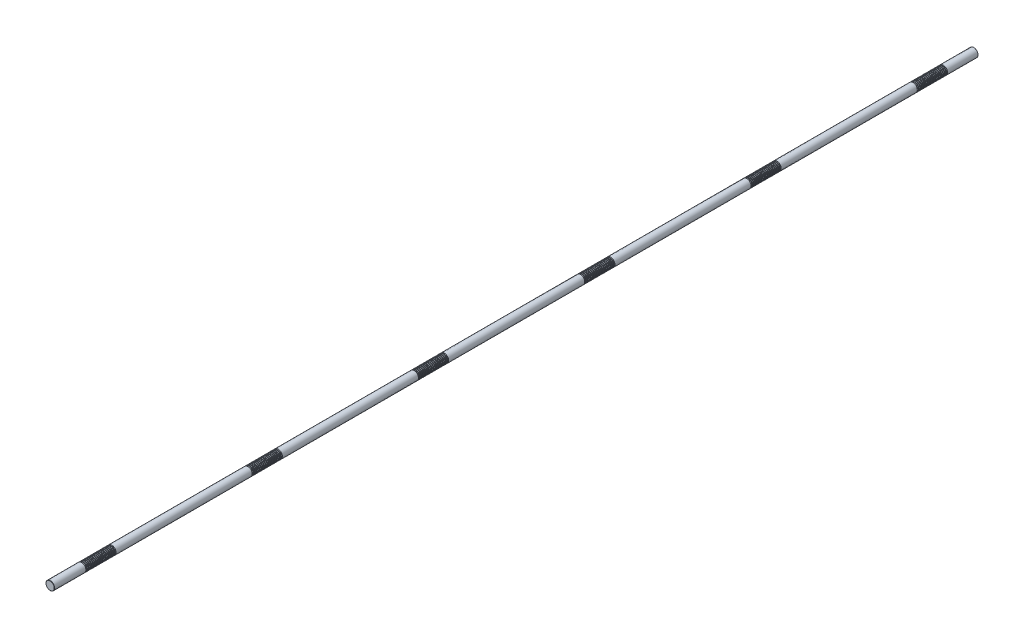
from build123d import *

# Parameters (mm, degrees)
SKETCH1_R           = 14
BOSS_EXTRUDE1_DEPTH = 1500
CHAMFER1_SIZE       = 0.7
LPATTERN1_COUNT     = 20
LPATTERN1_PITCH     = 5
LPATTERN2_COUNT     = 6
LPATTERN2_PITCH     = 540


with BuildPart() as part:
    # Sketch1 → Boss-Extrude1 (new, symmetric)
    with BuildSketch(Plane.XY):
        Circle(SKETCH1_R)
    extrude(amount=BOSS_EXTRUDE1_DEPTH, both=True)

    # Chamfer1
    chamfer1_edges = [part.edges().sort_by_distance(p)[0] for p in [
        (-14, 0, -1500),
        (-14, 0, 1500),
    ]]
    chamfer(chamfer1_edges, length=CHAMFER1_SIZE)

    # Sketch2 → Cut-Revolve1 (revolve, cut)
    with BuildSketch(Plane(origin=(0, 0, 0), x_dir=(0, 0, -1), z_dir=(1, 0, 0)), mode=Mode.PRIVATE) as cut_revolve1_sk:
        Polygon((1400.36843014, 14), (1397.13156986, 14), (1397.86843014, 11.25), (1399.63156986, 11.25), align=None)
    cut_revolve1 = revolve(cut_revolve1_sk.sketch.rotate(Axis((0, 0, 1500), (0, 0, -1)), 90), axis=Axis((0, 0, 1500), (0, 0, -1)), mode=Mode.SUBTRACT)

    # LPattern1: Cut-Revolve1 ×20
    with Locations(*[(0, 0, i * LPATTERN1_PITCH) for i in range(1, LPATTERN1_COUNT)]):
        add(cut_revolve1, mode=Mode.SUBTRACT)

    # LPattern2: Cut-Revolve1 ×6
    with Locations(*[(0, 0, i * LPATTERN2_PITCH) for i in range(1, LPATTERN2_COUNT)]):
        add(cut_revolve1, mode=Mode.SUBTRACT)

    # LPattern2 copy 1 sketch → LPattern2 copy 1 (revolve, cut)
    with BuildSketch(Plane(origin=(0, 0, 545), x_dir=(0, 0, -1), z_dir=(1, 0, 0))):
        Polygon((1400.36843014, 14), (1397.13156986, 14), (1397.86843014, 11.25), (1399.63156986, 11.25), align=None)
    revolve(axis=Axis((0, 0, 2045), (0, 0, -1)), mode=Mode.SUBTRACT)

    # LPattern2 copy 2 sketch → LPattern2 copy 2 (revolve, cut)
    with BuildSketch(Plane(origin=(0, 0, 1085), x_dir=(0, 0, -1), z_dir=(1, 0, 0))):
        Polygon((1400.36843014, 14), (1397.13156986, 14), (1397.86843014, 11.25), (1399.63156986, 11.25), align=None)
    revolve(axis=Axis((0, 0, 2585), (0, 0, -1)), mode=Mode.SUBTRACT)

    # LPattern2 copy 3 sketch → LPattern2 copy 3 (revolve, cut)
    with BuildSketch(Plane(origin=(0, 0, 1625), x_dir=(0, 0, -1), z_dir=(1, 0, 0))):
        Polygon((1400.36843014, 14), (1397.13156986, 14), (1397.86843014, 11.25), (1399.63156986, 11.25), align=None)
    revolve(axis=Axis((0, 0, 3125), (0, 0, -1)), mode=Mode.SUBTRACT)

    # LPattern2 copy 4 sketch → LPattern2 copy 4 (revolve, cut)
    with BuildSketch(Plane(origin=(0, 0, 2165), x_dir=(0, 0, -1), z_dir=(1, 0, 0))):
        Polygon((1400.36843014, 14), (1397.13156986, 14), (1397.86843014, 11.25), (1399.63156986, 11.25), align=None)
    revolve(axis=Axis((0, 0, 3665), (0, 0, -1)), mode=Mode.SUBTRACT)

    # LPattern2 copy 5 sketch → LPattern2 copy 5 (revolve, cut)
    with BuildSketch(Plane(origin=(0, 0, 2705), x_dir=(0, 0, -1), z_dir=(1, 0, 0))):
        Polygon((1400.36843014, 14), (1397.13156986, 14), (1397.86843014, 11.25), (1399.63156986, 11.25), align=None)
    revolve(axis=Axis((0, 0, 4205), (0, 0, -1)), mode=Mode.SUBTRACT)

    # LPattern2 copy 6 sketch → LPattern2 copy 6 (revolve, cut)
    with BuildSketch(Plane(origin=(0, 0, 550), x_dir=(0, 0, -1), z_dir=(1, 0, 0))):
        Polygon((1400.36843014, 14), (1397.13156986, 14), (1397.86843014, 11.25), (1399.63156986, 11.25), align=None)
    revolve(axis=Axis((0, 0, 2050), (0, 0, -1)), mode=Mode.SUBTRACT)

    # LPattern2 copy 7 sketch → LPattern2 copy 7 (revolve, cut)
    with BuildSketch(Plane(origin=(0, 0, 1090), x_dir=(0, 0, -1), z_dir=(1, 0, 0))):
        Polygon((1400.36843014, 14), (1397.13156986, 14), (1397.86843014, 11.25), (1399.63156986, 11.25), align=None)
    revolve(axis=Axis((0, 0, 2590), (0, 0, -1)), mode=Mode.SUBTRACT)

    # LPattern2 copy 8 sketch → LPattern2 copy 8 (revolve, cut)
    with BuildSketch(Plane(origin=(0, 0, 1630), x_dir=(0, 0, -1), z_dir=(1, 0, 0))):
        Polygon((1400.36843014, 14), (1397.13156986, 14), (1397.86843014, 11.25), (1399.63156986, 11.25), align=None)
    revolve(axis=Axis((0, 0, 3130), (0, 0, -1)), mode=Mode.SUBTRACT)

    # LPattern2 copy 9 sketch → LPattern2 copy 9 (revolve, cut)
    with BuildSketch(Plane(origin=(0, 0, 2170), x_dir=(0, 0, -1), z_dir=(1, 0, 0))):
        Polygon((1400.36843014, 14), (1397.13156986, 14), (1397.86843014, 11.25), (1399.63156986, 11.25), align=None)
    revolve(axis=Axis((0, 0, 3670), (0, 0, -1)), mode=Mode.SUBTRACT)

    # LPattern2 copy 10 sketch → LPattern2 copy 10 (revolve, cut)
    with BuildSketch(Plane(origin=(0, 0, 2710), x_dir=(0, 0, -1), z_dir=(1, 0, 0))):
        Polygon((1400.36843014, 14), (1397.13156986, 14), (1397.86843014, 11.25), (1399.63156986, 11.25), align=None)
    revolve(axis=Axis((0, 0, 4210), (0, 0, -1)), mode=Mode.SUBTRACT)

    # LPattern2 copy 11 sketch → LPattern2 copy 11 (revolve, cut)
    with BuildSketch(Plane(origin=(0, 0, 555), x_dir=(0, 0, -1), z_dir=(1, 0, 0))):
        Polygon((1400.36843014, 14), (1397.13156986, 14), (1397.86843014, 11.25), (1399.63156986, 11.25), align=None)
    revolve(axis=Axis((0, 0, 2055), (0, 0, -1)), mode=Mode.SUBTRACT)

    # LPattern2 copy 12 sketch → LPattern2 copy 12 (revolve, cut)
    with BuildSketch(Plane(origin=(0, 0, 1095), x_dir=(0, 0, -1), z_dir=(1, 0, 0))):
        Polygon((1400.36843014, 14), (1397.13156986, 14), (1397.86843014, 11.25), (1399.63156986, 11.25), align=None)
    revolve(axis=Axis((0, 0, 2595), (0, 0, -1)), mode=Mode.SUBTRACT)

    # LPattern2 copy 13 sketch → LPattern2 copy 13 (revolve, cut)
    with BuildSketch(Plane(origin=(0, 0, 1635), x_dir=(0, 0, -1), z_dir=(1, 0, 0))):
        Polygon((1400.36843014, 14), (1397.13156986, 14), (1397.86843014, 11.25), (1399.63156986, 11.25), align=None)
    revolve(axis=Axis((0, 0, 3135), (0, 0, -1)), mode=Mode.SUBTRACT)

    # LPattern2 copy 14 sketch → LPattern2 copy 14 (revolve, cut)
    with BuildSketch(Plane(origin=(0, 0, 2175), x_dir=(0, 0, -1), z_dir=(1, 0, 0))):
        Polygon((1400.36843014, 14), (1397.13156986, 14), (1397.86843014, 11.25), (1399.63156986, 11.25), align=None)
    revolve(axis=Axis((0, 0, 3675), (0, 0, -1)), mode=Mode.SUBTRACT)

    # LPattern2 copy 15 sketch → LPattern2 copy 15 (revolve, cut)
    with BuildSketch(Plane(origin=(0, 0, 2715), x_dir=(0, 0, -1), z_dir=(1, 0, 0))):
        Polygon((1400.36843014, 14), (1397.13156986, 14), (1397.86843014, 11.25), (1399.63156986, 11.25), align=None)
    revolve(axis=Axis((0, 0, 4215), (0, 0, -1)), mode=Mode.SUBTRACT)

    # LPattern2 copy 16 sketch → LPattern2 copy 16 (revolve, cut)
    with BuildSketch(Plane(origin=(0, 0, 560), x_dir=(0, 0, -1), z_dir=(1, 0, 0))):
        Polygon((1400.36843014, 14), (1397.13156986, 14), (1397.86843014, 11.25), (1399.63156986, 11.25), align=None)
    revolve(axis=Axis((0, 0, 2060), (0, 0, -1)), mode=Mode.SUBTRACT)

    # LPattern2 copy 17 sketch → LPattern2 copy 17 (revolve, cut)
    with BuildSketch(Plane(origin=(0, 0, 1100), x_dir=(0, 0, -1), z_dir=(1, 0, 0))):
        Polygon((1400.36843014, 14), (1397.13156986, 14), (1397.86843014, 11.25), (1399.63156986, 11.25), align=None)
    revolve(axis=Axis((0, 0, 2600), (0, 0, -1)), mode=Mode.SUBTRACT)

    # LPattern2 copy 18 sketch → LPattern2 copy 18 (revolve, cut)
    with BuildSketch(Plane(origin=(0, 0, 1640), x_dir=(0, 0, -1), z_dir=(1, 0, 0))):
        Polygon((1400.36843014, 14), (1397.13156986, 14), (1397.86843014, 11.25), (1399.63156986, 11.25), align=None)
    revolve(axis=Axis((0, 0, 3140), (0, 0, -1)), mode=Mode.SUBTRACT)

    # LPattern2 copy 19 sketch → LPattern2 copy 19 (revolve, cut)
    with BuildSketch(Plane(origin=(0, 0, 2180), x_dir=(0, 0, -1), z_dir=(1, 0, 0))):
        Polygon((1400.36843014, 14), (1397.13156986, 14), (1397.86843014, 11.25), (1399.63156986, 11.25), align=None)
    revolve(axis=Axis((0, 0, 3680), (0, 0, -1)), mode=Mode.SUBTRACT)

    # LPattern2 copy 20 sketch → LPattern2 copy 20 (revolve, cut)
    with BuildSketch(Plane(origin=(0, 0, 2720), x_dir=(0, 0, -1), z_dir=(1, 0, 0))):
        Polygon((1400.36843014, 14), (1397.13156986, 14), (1397.86843014, 11.25), (1399.63156986, 11.25), align=None)
    revolve(axis=Axis((0, 0, 4220), (0, 0, -1)), mode=Mode.SUBTRACT)

    # LPattern2 copy 21 sketch → LPattern2 copy 21 (revolve, cut)
    with BuildSketch(Plane(origin=(0, 0, 565), x_dir=(0, 0, -1), z_dir=(1, 0, 0))):
        Polygon((1400.36843014, 14), (1397.13156986, 14), (1397.86843014, 11.25), (1399.63156986, 11.25), align=None)
    revolve(axis=Axis((0, 0, 2065), (0, 0, -1)), mode=Mode.SUBTRACT)

    # LPattern2 copy 22 sketch → LPattern2 copy 22 (revolve, cut)
    with BuildSketch(Plane(origin=(0, 0, 1105), x_dir=(0, 0, -1), z_dir=(1, 0, 0))):
        Polygon((1400.36843014, 14), (1397.13156986, 14), (1397.86843014, 11.25), (1399.63156986, 11.25), align=None)
    revolve(axis=Axis((0, 0, 2605), (0, 0, -1)), mode=Mode.SUBTRACT)

    # LPattern2 copy 23 sketch → LPattern2 copy 23 (revolve, cut)
    with BuildSketch(Plane(origin=(0, 0, 1645), x_dir=(0, 0, -1), z_dir=(1, 0, 0))):
        Polygon((1400.36843014, 14), (1397.13156986, 14), (1397.86843014, 11.25), (1399.63156986, 11.25), align=None)
    revolve(axis=Axis((0, 0, 3145), (0, 0, -1)), mode=Mode.SUBTRACT)

    # LPattern2 copy 24 sketch → LPattern2 copy 24 (revolve, cut)
    with BuildSketch(Plane(origin=(0, 0, 2185), x_dir=(0, 0, -1), z_dir=(1, 0, 0))):
        Polygon((1400.36843014, 14), (1397.13156986, 14), (1397.86843014, 11.25), (1399.63156986, 11.25), align=None)
    revolve(axis=Axis((0, 0, 3685), (0, 0, -1)), mode=Mode.SUBTRACT)

    # LPattern2 copy 25 sketch → LPattern2 copy 25 (revolve, cut)
    with BuildSketch(Plane(origin=(0, 0, 2725), x_dir=(0, 0, -1), z_dir=(1, 0, 0))):
        Polygon((1400.36843014, 14), (1397.13156986, 14), (1397.86843014, 11.25), (1399.63156986, 11.25), align=None)
    revolve(axis=Axis((0, 0, 4225), (0, 0, -1)), mode=Mode.SUBTRACT)

    # LPattern2 copy 26 sketch → LPattern2 copy 26 (revolve, cut)
    with BuildSketch(Plane(origin=(0, 0, 570), x_dir=(0, 0, -1), z_dir=(1, 0, 0))):
        Polygon((1400.36843014, 14), (1397.13156986, 14), (1397.86843014, 11.25), (1399.63156986, 11.25), align=None)
    revolve(axis=Axis((0, 0, 2070), (0, 0, -1)), mode=Mode.SUBTRACT)

    # LPattern2 copy 27 sketch → LPattern2 copy 27 (revolve, cut)
    with BuildSketch(Plane(origin=(0, 0, 1110), x_dir=(0, 0, -1), z_dir=(1, 0, 0))):
        Polygon((1400.36843014, 14), (1397.13156986, 14), (1397.86843014, 11.25), (1399.63156986, 11.25), align=None)
    revolve(axis=Axis((0, 0, 2610), (0, 0, -1)), mode=Mode.SUBTRACT)

    # LPattern2 copy 28 sketch → LPattern2 copy 28 (revolve, cut)
    with BuildSketch(Plane(origin=(0, 0, 1650), x_dir=(0, 0, -1), z_dir=(1, 0, 0))):
        Polygon((1400.36843014, 14), (1397.13156986, 14), (1397.86843014, 11.25), (1399.63156986, 11.25), align=None)
    revolve(axis=Axis((0, 0, 3150), (0, 0, -1)), mode=Mode.SUBTRACT)

    # LPattern2 copy 29 sketch → LPattern2 copy 29 (revolve, cut)
    with BuildSketch(Plane(origin=(0, 0, 2190), x_dir=(0, 0, -1), z_dir=(1, 0, 0))):
        Polygon((1400.36843014, 14), (1397.13156986, 14), (1397.86843014, 11.25), (1399.63156986, 11.25), align=None)
    revolve(axis=Axis((0, 0, 3690), (0, 0, -1)), mode=Mode.SUBTRACT)

    # LPattern2 copy 30 sketch → LPattern2 copy 30 (revolve, cut)
    with BuildSketch(Plane(origin=(0, 0, 2730), x_dir=(0, 0, -1), z_dir=(1, 0, 0))):
        Polygon((1400.36843014, 14), (1397.13156986, 14), (1397.86843014, 11.25), (1399.63156986, 11.25), align=None)
    revolve(axis=Axis((0, 0, 4230), (0, 0, -1)), mode=Mode.SUBTRACT)

    # LPattern2 copy 31 sketch → LPattern2 copy 31 (revolve, cut)
    with BuildSketch(Plane(origin=(0, 0, 575), x_dir=(0, 0, -1), z_dir=(1, 0, 0))):
        Polygon((1400.36843014, 14), (1397.13156986, 14), (1397.86843014, 11.25), (1399.63156986, 11.25), align=None)
    revolve(axis=Axis((0, 0, 2075), (0, 0, -1)), mode=Mode.SUBTRACT)

    # LPattern2 copy 32 sketch → LPattern2 copy 32 (revolve, cut)
    with BuildSketch(Plane(origin=(0, 0, 1115), x_dir=(0, 0, -1), z_dir=(1, 0, 0))):
        Polygon((1400.36843014, 14), (1397.13156986, 14), (1397.86843014, 11.25), (1399.63156986, 11.25), align=None)
    revolve(axis=Axis((0, 0, 2615), (0, 0, -1)), mode=Mode.SUBTRACT)

    # LPattern2 copy 33 sketch → LPattern2 copy 33 (revolve, cut)
    with BuildSketch(Plane(origin=(0, 0, 1655), x_dir=(0, 0, -1), z_dir=(1, 0, 0))):
        Polygon((1400.36843014, 14), (1397.13156986, 14), (1397.86843014, 11.25), (1399.63156986, 11.25), align=None)
    revolve(axis=Axis((0, 0, 3155), (0, 0, -1)), mode=Mode.SUBTRACT)

    # LPattern2 copy 34 sketch → LPattern2 copy 34 (revolve, cut)
    with BuildSketch(Plane(origin=(0, 0, 2195), x_dir=(0, 0, -1), z_dir=(1, 0, 0))):
        Polygon((1400.36843014, 14), (1397.13156986, 14), (1397.86843014, 11.25), (1399.63156986, 11.25), align=None)
    revolve(axis=Axis((0, 0, 3695), (0, 0, -1)), mode=Mode.SUBTRACT)

    # LPattern2 copy 35 sketch → LPattern2 copy 35 (revolve, cut)
    with BuildSketch(Plane(origin=(0, 0, 2735), x_dir=(0, 0, -1), z_dir=(1, 0, 0))):
        Polygon((1400.36843014, 14), (1397.13156986, 14), (1397.86843014, 11.25), (1399.63156986, 11.25), align=None)
    revolve(axis=Axis((0, 0, 4235), (0, 0, -1)), mode=Mode.SUBTRACT)

    # LPattern2 copy 36 sketch → LPattern2 copy 36 (revolve, cut)
    with BuildSketch(Plane(origin=(0, 0, 580), x_dir=(0, 0, -1), z_dir=(1, 0, 0))):
        Polygon((1400.36843014, 14), (1397.13156986, 14), (1397.86843014, 11.25), (1399.63156986, 11.25), align=None)
    revolve(axis=Axis((0, 0, 2080), (0, 0, -1)), mode=Mode.SUBTRACT)

    # LPattern2 copy 37 sketch → LPattern2 copy 37 (revolve, cut)
    with BuildSketch(Plane(origin=(0, 0, 1120), x_dir=(0, 0, -1), z_dir=(1, 0, 0))):
        Polygon((1400.36843014, 14), (1397.13156986, 14), (1397.86843014, 11.25), (1399.63156986, 11.25), align=None)
    revolve(axis=Axis((0, 0, 2620), (0, 0, -1)), mode=Mode.SUBTRACT)

    # LPattern2 copy 38 sketch → LPattern2 copy 38 (revolve, cut)
    with BuildSketch(Plane(origin=(0, 0, 1660), x_dir=(0, 0, -1), z_dir=(1, 0, 0))):
        Polygon((1400.36843014, 14), (1397.13156986, 14), (1397.86843014, 11.25), (1399.63156986, 11.25), align=None)
    revolve(axis=Axis((0, 0, 3160), (0, 0, -1)), mode=Mode.SUBTRACT)

    # LPattern2 copy 39 sketch → LPattern2 copy 39 (revolve, cut)
    with BuildSketch(Plane(origin=(0, 0, 2200), x_dir=(0, 0, -1), z_dir=(1, 0, 0))):
        Polygon((1400.36843014, 14), (1397.13156986, 14), (1397.86843014, 11.25), (1399.63156986, 11.25), align=None)
    revolve(axis=Axis((0, 0, 3700), (0, 0, -1)), mode=Mode.SUBTRACT)

    # LPattern2 copy 40 sketch → LPattern2 copy 40 (revolve, cut)
    with BuildSketch(Plane(origin=(0, 0, 2740), x_dir=(0, 0, -1), z_dir=(1, 0, 0))):
        Polygon((1400.36843014, 14), (1397.13156986, 14), (1397.86843014, 11.25), (1399.63156986, 11.25), align=None)
    revolve(axis=Axis((0, 0, 4240), (0, 0, -1)), mode=Mode.SUBTRACT)

    # LPattern2 copy 41 sketch → LPattern2 copy 41 (revolve, cut)
    with BuildSketch(Plane(origin=(0, 0, 585), x_dir=(0, 0, -1), z_dir=(1, 0, 0))):
        Polygon((1400.36843014, 14), (1397.13156986, 14), (1397.86843014, 11.25), (1399.63156986, 11.25), align=None)
    revolve(axis=Axis((0, 0, 2085), (0, 0, -1)), mode=Mode.SUBTRACT)

    # LPattern2 copy 42 sketch → LPattern2 copy 42 (revolve, cut)
    with BuildSketch(Plane(origin=(0, 0, 1125), x_dir=(0, 0, -1), z_dir=(1, 0, 0))):
        Polygon((1400.36843014, 14), (1397.13156986, 14), (1397.86843014, 11.25), (1399.63156986, 11.25), align=None)
    revolve(axis=Axis((0, 0, 2625), (0, 0, -1)), mode=Mode.SUBTRACT)

    # LPattern2 copy 43 sketch → LPattern2 copy 43 (revolve, cut)
    with BuildSketch(Plane(origin=(0, 0, 1665), x_dir=(0, 0, -1), z_dir=(1, 0, 0))):
        Polygon((1400.36843014, 14), (1397.13156986, 14), (1397.86843014, 11.25), (1399.63156986, 11.25), align=None)
    revolve(axis=Axis((0, 0, 3165), (0, 0, -1)), mode=Mode.SUBTRACT)

    # LPattern2 copy 44 sketch → LPattern2 copy 44 (revolve, cut)
    with BuildSketch(Plane(origin=(0, 0, 2205), x_dir=(0, 0, -1), z_dir=(1, 0, 0))):
        Polygon((1400.36843014, 14), (1397.13156986, 14), (1397.86843014, 11.25), (1399.63156986, 11.25), align=None)
    revolve(axis=Axis((0, 0, 3705), (0, 0, -1)), mode=Mode.SUBTRACT)

    # LPattern2 copy 45 sketch → LPattern2 copy 45 (revolve, cut)
    with BuildSketch(Plane(origin=(0, 0, 2745), x_dir=(0, 0, -1), z_dir=(1, 0, 0))):
        Polygon((1400.36843014, 14), (1397.13156986, 14), (1397.86843014, 11.25), (1399.63156986, 11.25), align=None)
    revolve(axis=Axis((0, 0, 4245), (0, 0, -1)), mode=Mode.SUBTRACT)

    # LPattern2 copy 46 sketch → LPattern2 copy 46 (revolve, cut)
    with BuildSketch(Plane(origin=(0, 0, 590), x_dir=(0, 0, -1), z_dir=(1, 0, 0))):
        Polygon((1400.36843014, 14), (1397.13156986, 14), (1397.86843014, 11.25), (1399.63156986, 11.25), align=None)
    revolve(axis=Axis((0, 0, 2090), (0, 0, -1)), mode=Mode.SUBTRACT)

    # LPattern2 copy 47 sketch → LPattern2 copy 47 (revolve, cut)
    with BuildSketch(Plane(origin=(0, 0, 1130), x_dir=(0, 0, -1), z_dir=(1, 0, 0))):
        Polygon((1400.36843014, 14), (1397.13156986, 14), (1397.86843014, 11.25), (1399.63156986, 11.25), align=None)
    revolve(axis=Axis((0, 0, 2630), (0, 0, -1)), mode=Mode.SUBTRACT)

    # LPattern2 copy 48 sketch → LPattern2 copy 48 (revolve, cut)
    with BuildSketch(Plane(origin=(0, 0, 1670), x_dir=(0, 0, -1), z_dir=(1, 0, 0))):
        Polygon((1400.36843014, 14), (1397.13156986, 14), (1397.86843014, 11.25), (1399.63156986, 11.25), align=None)
    revolve(axis=Axis((0, 0, 3170), (0, 0, -1)), mode=Mode.SUBTRACT)

    # LPattern2 copy 49 sketch → LPattern2 copy 49 (revolve, cut)
    with BuildSketch(Plane(origin=(0, 0, 2210), x_dir=(0, 0, -1), z_dir=(1, 0, 0))):
        Polygon((1400.36843014, 14), (1397.13156986, 14), (1397.86843014, 11.25), (1399.63156986, 11.25), align=None)
    revolve(axis=Axis((0, 0, 3710), (0, 0, -1)), mode=Mode.SUBTRACT)

    # LPattern2 copy 50 sketch → LPattern2 copy 50 (revolve, cut)
    with BuildSketch(Plane(origin=(0, 0, 2750), x_dir=(0, 0, -1), z_dir=(1, 0, 0))):
        Polygon((1400.36843014, 14), (1397.13156986, 14), (1397.86843014, 11.25), (1399.63156986, 11.25), align=None)
    revolve(axis=Axis((0, 0, 4250), (0, 0, -1)), mode=Mode.SUBTRACT)

    # LPattern2 copy 51 sketch → LPattern2 copy 51 (revolve, cut)
    with BuildSketch(Plane(origin=(0, 0, 595), x_dir=(0, 0, -1), z_dir=(1, 0, 0))):
        Polygon((1400.36843014, 14), (1397.13156986, 14), (1397.86843014, 11.25), (1399.63156986, 11.25), align=None)
    revolve(axis=Axis((0, 0, 2095), (0, 0, -1)), mode=Mode.SUBTRACT)

    # LPattern2 copy 52 sketch → LPattern2 copy 52 (revolve, cut)
    with BuildSketch(Plane(origin=(0, 0, 1135), x_dir=(0, 0, -1), z_dir=(1, 0, 0))):
        Polygon((1400.36843014, 14), (1397.13156986, 14), (1397.86843014, 11.25), (1399.63156986, 11.25), align=None)
    revolve(axis=Axis((0, 0, 2635), (0, 0, -1)), mode=Mode.SUBTRACT)

    # LPattern2 copy 53 sketch → LPattern2 copy 53 (revolve, cut)
    with BuildSketch(Plane(origin=(0, 0, 1675), x_dir=(0, 0, -1), z_dir=(1, 0, 0))):
        Polygon((1400.36843014, 14), (1397.13156986, 14), (1397.86843014, 11.25), (1399.63156986, 11.25), align=None)
    revolve(axis=Axis((0, 0, 3175), (0, 0, -1)), mode=Mode.SUBTRACT)

    # LPattern2 copy 54 sketch → LPattern2 copy 54 (revolve, cut)
    with BuildSketch(Plane(origin=(0, 0, 2215), x_dir=(0, 0, -1), z_dir=(1, 0, 0))):
        Polygon((1400.36843014, 14), (1397.13156986, 14), (1397.86843014, 11.25), (1399.63156986, 11.25), align=None)
    revolve(axis=Axis((0, 0, 3715), (0, 0, -1)), mode=Mode.SUBTRACT)

    # LPattern2 copy 55 sketch → LPattern2 copy 55 (revolve, cut)
    with BuildSketch(Plane(origin=(0, 0, 2755), x_dir=(0, 0, -1), z_dir=(1, 0, 0))):
        Polygon((1400.36843014, 14), (1397.13156986, 14), (1397.86843014, 11.25), (1399.63156986, 11.25), align=None)
    revolve(axis=Axis((0, 0, 4255), (0, 0, -1)), mode=Mode.SUBTRACT)

    # LPattern2 copy 56 sketch → LPattern2 copy 56 (revolve, cut)
    with BuildSketch(Plane(origin=(0, 0, 600), x_dir=(0, 0, -1), z_dir=(1, 0, 0))):
        Polygon((1400.36843014, 14), (1397.13156986, 14), (1397.86843014, 11.25), (1399.63156986, 11.25), align=None)
    revolve(axis=Axis((0, 0, 2100), (0, 0, -1)), mode=Mode.SUBTRACT)

    # LPattern2 copy 57 sketch → LPattern2 copy 57 (revolve, cut)
    with BuildSketch(Plane(origin=(0, 0, 1140), x_dir=(0, 0, -1), z_dir=(1, 0, 0))):
        Polygon((1400.36843014, 14), (1397.13156986, 14), (1397.86843014, 11.25), (1399.63156986, 11.25), align=None)
    revolve(axis=Axis((0, 0, 2640), (0, 0, -1)), mode=Mode.SUBTRACT)

    # LPattern2 copy 58 sketch → LPattern2 copy 58 (revolve, cut)
    with BuildSketch(Plane(origin=(0, 0, 1680), x_dir=(0, 0, -1), z_dir=(1, 0, 0))):
        Polygon((1400.36843014, 14), (1397.13156986, 14), (1397.86843014, 11.25), (1399.63156986, 11.25), align=None)
    revolve(axis=Axis((0, 0, 3180), (0, 0, -1)), mode=Mode.SUBTRACT)

    # LPattern2 copy 59 sketch → LPattern2 copy 59 (revolve, cut)
    with BuildSketch(Plane(origin=(0, 0, 2220), x_dir=(0, 0, -1), z_dir=(1, 0, 0))):
        Polygon((1400.36843014, 14), (1397.13156986, 14), (1397.86843014, 11.25), (1399.63156986, 11.25), align=None)
    revolve(axis=Axis((0, 0, 3720), (0, 0, -1)), mode=Mode.SUBTRACT)

    # LPattern2 copy 60 sketch → LPattern2 copy 60 (revolve, cut)
    with BuildSketch(Plane(origin=(0, 0, 2760), x_dir=(0, 0, -1), z_dir=(1, 0, 0))):
        Polygon((1400.36843014, 14), (1397.13156986, 14), (1397.86843014, 11.25), (1399.63156986, 11.25), align=None)
    revolve(axis=Axis((0, 0, 4260), (0, 0, -1)), mode=Mode.SUBTRACT)

    # LPattern2 copy 61 sketch → LPattern2 copy 61 (revolve, cut)
    with BuildSketch(Plane(origin=(0, 0, 605), x_dir=(0, 0, -1), z_dir=(1, 0, 0))):
        Polygon((1400.36843014, 14), (1397.13156986, 14), (1397.86843014, 11.25), (1399.63156986, 11.25), align=None)
    revolve(axis=Axis((0, 0, 2105), (0, 0, -1)), mode=Mode.SUBTRACT)

    # LPattern2 copy 62 sketch → LPattern2 copy 62 (revolve, cut)
    with BuildSketch(Plane(origin=(0, 0, 1145), x_dir=(0, 0, -1), z_dir=(1, 0, 0))):
        Polygon((1400.36843014, 14), (1397.13156986, 14), (1397.86843014, 11.25), (1399.63156986, 11.25), align=None)
    revolve(axis=Axis((0, 0, 2645), (0, 0, -1)), mode=Mode.SUBTRACT)

    # LPattern2 copy 63 sketch → LPattern2 copy 63 (revolve, cut)
    with BuildSketch(Plane(origin=(0, 0, 1685), x_dir=(0, 0, -1), z_dir=(1, 0, 0))):
        Polygon((1400.36843014, 14), (1397.13156986, 14), (1397.86843014, 11.25), (1399.63156986, 11.25), align=None)
    revolve(axis=Axis((0, 0, 3185), (0, 0, -1)), mode=Mode.SUBTRACT)

    # LPattern2 copy 64 sketch → LPattern2 copy 64 (revolve, cut)
    with BuildSketch(Plane(origin=(0, 0, 2225), x_dir=(0, 0, -1), z_dir=(1, 0, 0))):
        Polygon((1400.36843014, 14), (1397.13156986, 14), (1397.86843014, 11.25), (1399.63156986, 11.25), align=None)
    revolve(axis=Axis((0, 0, 3725), (0, 0, -1)), mode=Mode.SUBTRACT)

    # LPattern2 copy 65 sketch → LPattern2 copy 65 (revolve, cut)
    with BuildSketch(Plane(origin=(0, 0, 2765), x_dir=(0, 0, -1), z_dir=(1, 0, 0))):
        Polygon((1400.36843014, 14), (1397.13156986, 14), (1397.86843014, 11.25), (1399.63156986, 11.25), align=None)
    revolve(axis=Axis((0, 0, 4265), (0, 0, -1)), mode=Mode.SUBTRACT)

    # LPattern2 copy 66 sketch → LPattern2 copy 66 (revolve, cut)
    with BuildSketch(Plane(origin=(0, 0, 610), x_dir=(0, 0, -1), z_dir=(1, 0, 0))):
        Polygon((1400.36843014, 14), (1397.13156986, 14), (1397.86843014, 11.25), (1399.63156986, 11.25), align=None)
    revolve(axis=Axis((0, 0, 2110), (0, 0, -1)), mode=Mode.SUBTRACT)

    # LPattern2 copy 67 sketch → LPattern2 copy 67 (revolve, cut)
    with BuildSketch(Plane(origin=(0, 0, 1150), x_dir=(0, 0, -1), z_dir=(1, 0, 0))):
        Polygon((1400.36843014, 14), (1397.13156986, 14), (1397.86843014, 11.25), (1399.63156986, 11.25), align=None)
    revolve(axis=Axis((0, 0, 2650), (0, 0, -1)), mode=Mode.SUBTRACT)

    # LPattern2 copy 68 sketch → LPattern2 copy 68 (revolve, cut)
    with BuildSketch(Plane(origin=(0, 0, 1690), x_dir=(0, 0, -1), z_dir=(1, 0, 0))):
        Polygon((1400.36843014, 14), (1397.13156986, 14), (1397.86843014, 11.25), (1399.63156986, 11.25), align=None)
    revolve(axis=Axis((0, 0, 3190), (0, 0, -1)), mode=Mode.SUBTRACT)

    # LPattern2 copy 69 sketch → LPattern2 copy 69 (revolve, cut)
    with BuildSketch(Plane(origin=(0, 0, 2230), x_dir=(0, 0, -1), z_dir=(1, 0, 0))):
        Polygon((1400.36843014, 14), (1397.13156986, 14), (1397.86843014, 11.25), (1399.63156986, 11.25), align=None)
    revolve(axis=Axis((0, 0, 3730), (0, 0, -1)), mode=Mode.SUBTRACT)

    # LPattern2 copy 70 sketch → LPattern2 copy 70 (revolve, cut)
    with BuildSketch(Plane(origin=(0, 0, 2770), x_dir=(0, 0, -1), z_dir=(1, 0, 0))):
        Polygon((1400.36843014, 14), (1397.13156986, 14), (1397.86843014, 11.25), (1399.63156986, 11.25), align=None)
    revolve(axis=Axis((0, 0, 4270), (0, 0, -1)), mode=Mode.SUBTRACT)

    # LPattern2 copy 71 sketch → LPattern2 copy 71 (revolve, cut)
    with BuildSketch(Plane(origin=(0, 0, 615), x_dir=(0, 0, -1), z_dir=(1, 0, 0))):
        Polygon((1400.36843014, 14), (1397.13156986, 14), (1397.86843014, 11.25), (1399.63156986, 11.25), align=None)
    revolve(axis=Axis((0, 0, 2115), (0, 0, -1)), mode=Mode.SUBTRACT)

    # LPattern2 copy 72 sketch → LPattern2 copy 72 (revolve, cut)
    with BuildSketch(Plane(origin=(0, 0, 1155), x_dir=(0, 0, -1), z_dir=(1, 0, 0))):
        Polygon((1400.36843014, 14), (1397.13156986, 14), (1397.86843014, 11.25), (1399.63156986, 11.25), align=None)
    revolve(axis=Axis((0, 0, 2655), (0, 0, -1)), mode=Mode.SUBTRACT)

    # LPattern2 copy 73 sketch → LPattern2 copy 73 (revolve, cut)
    with BuildSketch(Plane(origin=(0, 0, 1695), x_dir=(0, 0, -1), z_dir=(1, 0, 0))):
        Polygon((1400.36843014, 14), (1397.13156986, 14), (1397.86843014, 11.25), (1399.63156986, 11.25), align=None)
    revolve(axis=Axis((0, 0, 3195), (0, 0, -1)), mode=Mode.SUBTRACT)

    # LPattern2 copy 74 sketch → LPattern2 copy 74 (revolve, cut)
    with BuildSketch(Plane(origin=(0, 0, 2235), x_dir=(0, 0, -1), z_dir=(1, 0, 0))):
        Polygon((1400.36843014, 14), (1397.13156986, 14), (1397.86843014, 11.25), (1399.63156986, 11.25), align=None)
    revolve(axis=Axis((0, 0, 3735), (0, 0, -1)), mode=Mode.SUBTRACT)

    # LPattern2 copy 75 sketch → LPattern2 copy 75 (revolve, cut)
    with BuildSketch(Plane(origin=(0, 0, 2775), x_dir=(0, 0, -1), z_dir=(1, 0, 0))):
        Polygon((1400.36843014, 14), (1397.13156986, 14), (1397.86843014, 11.25), (1399.63156986, 11.25), align=None)
    revolve(axis=Axis((0, 0, 4275), (0, 0, -1)), mode=Mode.SUBTRACT)

    # LPattern2 copy 76 sketch → LPattern2 copy 76 (revolve, cut)
    with BuildSketch(Plane(origin=(0, 0, 620), x_dir=(0, 0, -1), z_dir=(1, 0, 0))):
        Polygon((1400.36843014, 14), (1397.13156986, 14), (1397.86843014, 11.25), (1399.63156986, 11.25), align=None)
    revolve(axis=Axis((0, 0, 2120), (0, 0, -1)), mode=Mode.SUBTRACT)

    # LPattern2 copy 77 sketch → LPattern2 copy 77 (revolve, cut)
    with BuildSketch(Plane(origin=(0, 0, 1160), x_dir=(0, 0, -1), z_dir=(1, 0, 0))):
        Polygon((1400.36843014, 14), (1397.13156986, 14), (1397.86843014, 11.25), (1399.63156986, 11.25), align=None)
    revolve(axis=Axis((0, 0, 2660), (0, 0, -1)), mode=Mode.SUBTRACT)

    # LPattern2 copy 78 sketch → LPattern2 copy 78 (revolve, cut)
    with BuildSketch(Plane(origin=(0, 0, 1700), x_dir=(0, 0, -1), z_dir=(1, 0, 0))):
        Polygon((1400.36843014, 14), (1397.13156986, 14), (1397.86843014, 11.25), (1399.63156986, 11.25), align=None)
    revolve(axis=Axis((0, 0, 3200), (0, 0, -1)), mode=Mode.SUBTRACT)

    # LPattern2 copy 79 sketch → LPattern2 copy 79 (revolve, cut)
    with BuildSketch(Plane(origin=(0, 0, 2240), x_dir=(0, 0, -1), z_dir=(1, 0, 0))):
        Polygon((1400.36843014, 14), (1397.13156986, 14), (1397.86843014, 11.25), (1399.63156986, 11.25), align=None)
    revolve(axis=Axis((0, 0, 3740), (0, 0, -1)), mode=Mode.SUBTRACT)

    # LPattern2 copy 80 sketch → LPattern2 copy 80 (revolve, cut)
    with BuildSketch(Plane(origin=(0, 0, 2780), x_dir=(0, 0, -1), z_dir=(1, 0, 0))):
        Polygon((1400.36843014, 14), (1397.13156986, 14), (1397.86843014, 11.25), (1399.63156986, 11.25), align=None)
    revolve(axis=Axis((0, 0, 4280), (0, 0, -1)), mode=Mode.SUBTRACT)

    # LPattern2 copy 81 sketch → LPattern2 copy 81 (revolve, cut)
    with BuildSketch(Plane(origin=(0, 0, 625), x_dir=(0, 0, -1), z_dir=(1, 0, 0))):
        Polygon((1400.36843014, 14), (1397.13156986, 14), (1397.86843014, 11.25), (1399.63156986, 11.25), align=None)
    revolve(axis=Axis((0, 0, 2125), (0, 0, -1)), mode=Mode.SUBTRACT)

    # LPattern2 copy 82 sketch → LPattern2 copy 82 (revolve, cut)
    with BuildSketch(Plane(origin=(0, 0, 1165), x_dir=(0, 0, -1), z_dir=(1, 0, 0))):
        Polygon((1400.36843014, 14), (1397.13156986, 14), (1397.86843014, 11.25), (1399.63156986, 11.25), align=None)
    revolve(axis=Axis((0, 0, 2665), (0, 0, -1)), mode=Mode.SUBTRACT)

    # LPattern2 copy 83 sketch → LPattern2 copy 83 (revolve, cut)
    with BuildSketch(Plane(origin=(0, 0, 1705), x_dir=(0, 0, -1), z_dir=(1, 0, 0))):
        Polygon((1400.36843014, 14), (1397.13156986, 14), (1397.86843014, 11.25), (1399.63156986, 11.25), align=None)
    revolve(axis=Axis((0, 0, 3205), (0, 0, -1)), mode=Mode.SUBTRACT)

    # LPattern2 copy 84 sketch → LPattern2 copy 84 (revolve, cut)
    with BuildSketch(Plane(origin=(0, 0, 2245), x_dir=(0, 0, -1), z_dir=(1, 0, 0))):
        Polygon((1400.36843014, 14), (1397.13156986, 14), (1397.86843014, 11.25), (1399.63156986, 11.25), align=None)
    revolve(axis=Axis((0, 0, 3745), (0, 0, -1)), mode=Mode.SUBTRACT)

    # LPattern2 copy 85 sketch → LPattern2 copy 85 (revolve, cut)
    with BuildSketch(Plane(origin=(0, 0, 2785), x_dir=(0, 0, -1), z_dir=(1, 0, 0))):
        Polygon((1400.36843014, 14), (1397.13156986, 14), (1397.86843014, 11.25), (1399.63156986, 11.25), align=None)
    revolve(axis=Axis((0, 0, 4285), (0, 0, -1)), mode=Mode.SUBTRACT)

    # LPattern2 copy 86 sketch → LPattern2 copy 86 (revolve, cut)
    with BuildSketch(Plane(origin=(0, 0, 630), x_dir=(0, 0, -1), z_dir=(1, 0, 0))):
        Polygon((1400.36843014, 14), (1397.13156986, 14), (1397.86843014, 11.25), (1399.63156986, 11.25), align=None)
    revolve(axis=Axis((0, 0, 2130), (0, 0, -1)), mode=Mode.SUBTRACT)

    # LPattern2 copy 87 sketch → LPattern2 copy 87 (revolve, cut)
    with BuildSketch(Plane(origin=(0, 0, 1170), x_dir=(0, 0, -1), z_dir=(1, 0, 0))):
        Polygon((1400.36843014, 14), (1397.13156986, 14), (1397.86843014, 11.25), (1399.63156986, 11.25), align=None)
    revolve(axis=Axis((0, 0, 2670), (0, 0, -1)), mode=Mode.SUBTRACT)

    # LPattern2 copy 88 sketch → LPattern2 copy 88 (revolve, cut)
    with BuildSketch(Plane(origin=(0, 0, 1710), x_dir=(0, 0, -1), z_dir=(1, 0, 0))):
        Polygon((1400.36843014, 14), (1397.13156986, 14), (1397.86843014, 11.25), (1399.63156986, 11.25), align=None)
    revolve(axis=Axis((0, 0, 3210), (0, 0, -1)), mode=Mode.SUBTRACT)

    # LPattern2 copy 89 sketch → LPattern2 copy 89 (revolve, cut)
    with BuildSketch(Plane(origin=(0, 0, 2250), x_dir=(0, 0, -1), z_dir=(1, 0, 0))):
        Polygon((1400.36843014, 14), (1397.13156986, 14), (1397.86843014, 11.25), (1399.63156986, 11.25), align=None)
    revolve(axis=Axis((0, 0, 3750), (0, 0, -1)), mode=Mode.SUBTRACT)

    # LPattern2 copy 90 sketch → LPattern2 copy 90 (revolve, cut)
    with BuildSketch(Plane(origin=(0, 0, 2790), x_dir=(0, 0, -1), z_dir=(1, 0, 0))):
        Polygon((1400.36843014, 14), (1397.13156986, 14), (1397.86843014, 11.25), (1399.63156986, 11.25), align=None)
    revolve(axis=Axis((0, 0, 4290), (0, 0, -1)), mode=Mode.SUBTRACT)

    # LPattern2 copy 91 sketch → LPattern2 copy 91 (revolve, cut)
    with BuildSketch(Plane(origin=(0, 0, 635), x_dir=(0, 0, -1), z_dir=(1, 0, 0))):
        Polygon((1400.36843014, 14), (1397.13156986, 14), (1397.86843014, 11.25), (1399.63156986, 11.25), align=None)
    revolve(axis=Axis((0, 0, 2135), (0, 0, -1)), mode=Mode.SUBTRACT)

    # LPattern2 copy 92 sketch → LPattern2 copy 92 (revolve, cut)
    with BuildSketch(Plane(origin=(0, 0, 1175), x_dir=(0, 0, -1), z_dir=(1, 0, 0))):
        Polygon((1400.36843014, 14), (1397.13156986, 14), (1397.86843014, 11.25), (1399.63156986, 11.25), align=None)
    revolve(axis=Axis((0, 0, 2675), (0, 0, -1)), mode=Mode.SUBTRACT)

    # LPattern2 copy 93 sketch → LPattern2 copy 93 (revolve, cut)
    with BuildSketch(Plane(origin=(0, 0, 1715), x_dir=(0, 0, -1), z_dir=(1, 0, 0))):
        Polygon((1400.36843014, 14), (1397.13156986, 14), (1397.86843014, 11.25), (1399.63156986, 11.25), align=None)
    revolve(axis=Axis((0, 0, 3215), (0, 0, -1)), mode=Mode.SUBTRACT)

    # LPattern2 copy 94 sketch → LPattern2 copy 94 (revolve, cut)
    with BuildSketch(Plane(origin=(0, 0, 2255), x_dir=(0, 0, -1), z_dir=(1, 0, 0))):
        Polygon((1400.36843014, 14), (1397.13156986, 14), (1397.86843014, 11.25), (1399.63156986, 11.25), align=None)
    revolve(axis=Axis((0, 0, 3755), (0, 0, -1)), mode=Mode.SUBTRACT)

    # LPattern2 copy 95 sketch → LPattern2 copy 95 (revolve, cut)
    with BuildSketch(Plane(origin=(0, 0, 2795), x_dir=(0, 0, -1), z_dir=(1, 0, 0))):
        Polygon((1400.36843014, 14), (1397.13156986, 14), (1397.86843014, 11.25), (1399.63156986, 11.25), align=None)
    revolve(axis=Axis((0, 0, 4295), (0, 0, -1)), mode=Mode.SUBTRACT)


solid = part.part
